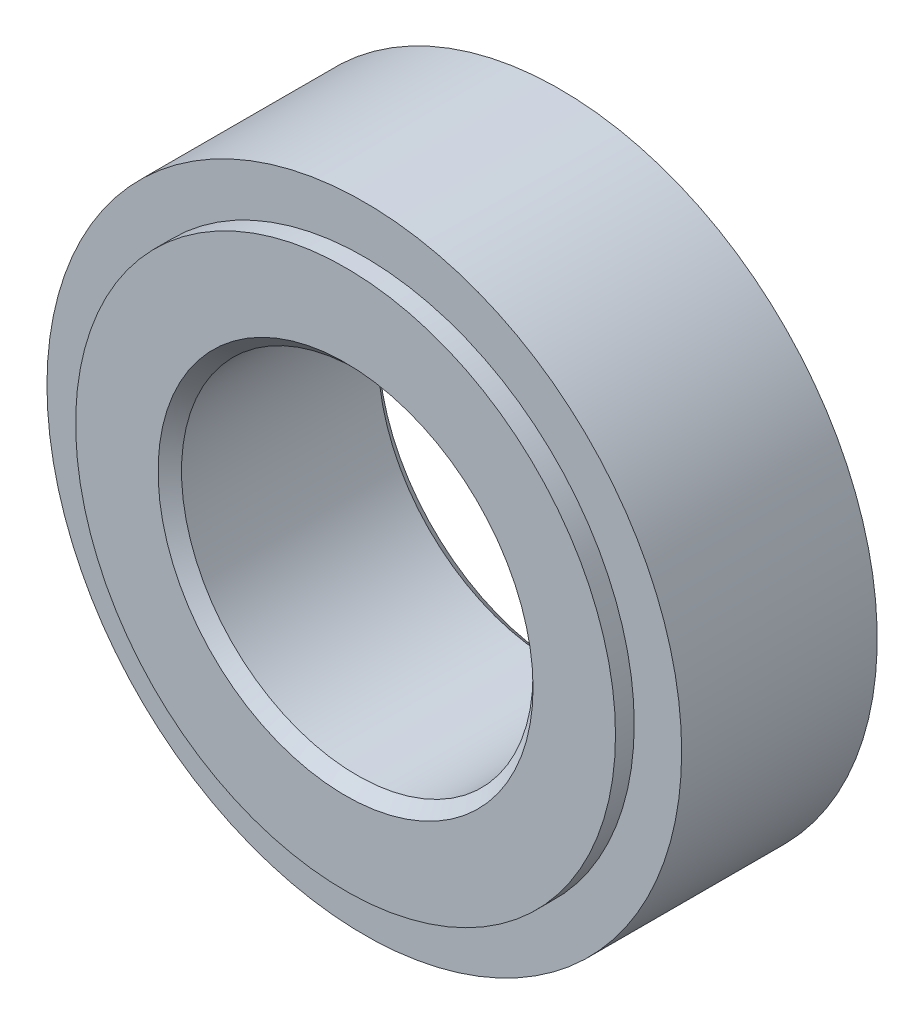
ISO-10303-21;
HEADER;
FILE_DESCRIPTION(('STEP AP214'),'2;1');
FILE_NAME('part.step','',(''),(''),'','','');
FILE_SCHEMA(('AUTOMOTIVE_DESIGN { 1 0 10303 214 1 1 1 1 }'));
ENDSEC;
DATA;
#1=APPLICATION_CONTEXT('core data for automotive mechanical design processes');
#2=APPLICATION_PROTOCOL_DEFINITION('international standard','automotive_design',2000,#1);
#3=PRODUCT_CONTEXT('',#1,'mechanical');
#4=PRODUCT('Part','Part','',(#3));
#5=PRODUCT_RELATED_PRODUCT_CATEGORY('part','',(#4));
#6=PRODUCT_DEFINITION_FORMATION('','',#4);
#7=PRODUCT_DEFINITION_CONTEXT('part definition',#1,'design');
#8=PRODUCT_DEFINITION('design','',#6,#7);
#9=PRODUCT_DEFINITION_SHAPE('','',#8);
#10=(LENGTH_UNIT() NAMED_UNIT(*) SI_UNIT(.MILLI.,.METRE.));
#11=(NAMED_UNIT(*) PLANE_ANGLE_UNIT() SI_UNIT($,.RADIAN.));
#12=(NAMED_UNIT(*) SI_UNIT($,.STERADIAN.) SOLID_ANGLE_UNIT());
#13=UNCERTAINTY_MEASURE_WITH_UNIT(LENGTH_MEASURE(1.E-05),#10,'distance_accuracy_value','');
#14=(GEOMETRIC_REPRESENTATION_CONTEXT(3) GLOBAL_UNCERTAINTY_ASSIGNED_CONTEXT((#13)) GLOBAL_UNIT_ASSIGNED_CONTEXT((#10,
#11,#12)) REPRESENTATION_CONTEXT('',''));
#15=CARTESIAN_POINT('',(0.,0.,0.));
#16=DIRECTION('',(0.,0.,1.));
#17=DIRECTION('',(1.,0.,0.));
#18=AXIS2_PLACEMENT_3D('',#15,#16,#17);
#19=CARTESIAN_POINT('',(0.,0.,9.4));
#20=DIRECTION('',(0.,0.,-1.));
#21=DIRECTION('',(-1.,0.,0.));
#22=AXIS2_PLACEMENT_3D('',#19,#20,#21);
#23=CYLINDRICAL_SURFACE('',#22,27.1);
#24=CARTESIAN_POINT('',(0.,0.,7.8));
#25=DIRECTION('',(0.,0.,1.));
#26=DIRECTION('',(1.,0.,0.));
#27=AXIS2_PLACEMENT_3D('',#24,#25,#26);
#28=CIRCLE('',#27,27.1);
#29=CARTESIAN_POINT('',(27.1,0.,7.8));
#30=VERTEX_POINT('',#29);
#31=EDGE_CURVE('E100',#30,#30,#28,.T.);
#32=ORIENTED_EDGE('',*,*,#31,.F.);
#33=EDGE_LOOP('',(#32));
#34=FACE_BOUND('',#33,.T.);
#35=CARTESIAN_POINT('',(0.,0.,-8.9));
#36=DIRECTION('',(0.,0.,-1.));
#37=DIRECTION('',(-1.,0.,0.));
#38=AXIS2_PLACEMENT_3D('',#35,#36,#37);
#39=CIRCLE('',#38,27.1);
#40=CARTESIAN_POINT('',(-27.1,0.,-8.9));
#41=VERTEX_POINT('',#40);
#42=EDGE_CURVE('E91',#41,#41,#39,.F.);
#43=ORIENTED_EDGE('',*,*,#42,.T.);
#44=EDGE_LOOP('',(#43));
#45=FACE_BOUND('',#44,.T.);
#46=ADVANCED_FACE('F33',(#34,#45),#23,.T.);
#47=CARTESIAN_POINT('',(0.,0.,7.8));
#48=DIRECTION('',(0.,0.,1.));
#49=DIRECTION('',(1.,0.,0.));
#50=AXIS2_PLACEMENT_3D('',#47,#48,#49);
#51=CYLINDRICAL_SURFACE('',#50,23.05);
#52=CARTESIAN_POINT('',(0.,0.,7.8));
#53=DIRECTION('',(0.,0.,1.));
#54=DIRECTION('',(1.,0.,0.));
#55=AXIS2_PLACEMENT_3D('',#52,#53,#54);
#56=CIRCLE('',#55,23.05);
#57=CARTESIAN_POINT('',(23.05,0.,7.8));
#58=VERTEX_POINT('',#57);
#59=EDGE_CURVE('E97',#58,#58,#56,.T.);
#60=ORIENTED_EDGE('',*,*,#59,.T.);
#61=EDGE_LOOP('',(#60));
#62=FACE_BOUND('',#61,.T.);
#63=CARTESIAN_POINT('',(0.,0.,9.4));
#64=DIRECTION('',(0.,0.,1.));
#65=DIRECTION('',(1.,0.,0.));
#66=AXIS2_PLACEMENT_3D('',#63,#64,#65);
#67=CIRCLE('',#66,23.05);
#68=CARTESIAN_POINT('',(23.05,0.,9.4));
#69=VERTEX_POINT('',#68);
#70=EDGE_CURVE('E94',#69,#69,#67,.T.);
#71=ORIENTED_EDGE('',*,*,#70,.F.);
#72=EDGE_LOOP('',(#71));
#73=FACE_BOUND('',#72,.T.);
#74=ADVANCED_FACE('F144',(#62,#73),#51,.T.);
#75=CARTESIAN_POINT('',(0.,-59.7614213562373,7.8));
#76=DIRECTION('',(0.,0.,1.));
#77=DIRECTION('',(1.,0.,0.));
#78=AXIS2_PLACEMENT_3D('',#75,#76,#77);
#79=PLANE('',#78);
#80=ORIENTED_EDGE('',*,*,#59,.F.);
#81=EDGE_LOOP('',(#80));
#82=FACE_BOUND('',#81,.T.);
#83=ORIENTED_EDGE('',*,*,#31,.T.);
#84=EDGE_LOOP('',(#83));
#85=FACE_BOUND('',#84,.T.);
#86=ADVANCED_FACE('F140',(#82,#85),#79,.T.);
#87=CARTESIAN_POINT('',(0.,0.,9.4));
#88=DIRECTION('',(0.,0.,1.));
#89=DIRECTION('',(1.,0.,0.));
#90=AXIS2_PLACEMENT_3D('',#87,#88,#89);
#91=PLANE('',#90);
#92=CARTESIAN_POINT('',(0.,0.,9.4));
#93=DIRECTION('',(0.,0.,1.));
#94=DIRECTION('',(1.,0.,0.));
#95=AXIS2_PLACEMENT_3D('',#92,#93,#94);
#96=CIRCLE('',#95,16.01);
#97=CARTESIAN_POINT('',(16.01,0.,9.4));
#98=VERTEX_POINT('',#97);
#99=EDGE_CURVE('E11',#98,#98,#96,.F.);
#100=ORIENTED_EDGE('',*,*,#99,.T.);
#101=EDGE_LOOP('',(#100));
#102=FACE_BOUND('',#101,.T.);
#103=ORIENTED_EDGE('',*,*,#70,.T.);
#104=EDGE_LOOP('',(#103));
#105=FACE_BOUND('',#104,.T.);
#106=ADVANCED_FACE('F131',(#102,#105),#91,.T.);
#107=CARTESIAN_POINT('',(0.,0.,-8.9));
#108=DIRECTION('',(0.,0.,-1.));
#109=DIRECTION('',(-1.,0.,0.));
#110=AXIS2_PLACEMENT_3D('',#107,#108,#109);
#111=CYLINDRICAL_SURFACE('',#110,23.05);
#112=CARTESIAN_POINT('',(0.,0.,-8.9));
#113=DIRECTION('',(0.,0.,-1.));
#114=DIRECTION('',(-1.,0.,0.));
#115=AXIS2_PLACEMENT_3D('',#112,#113,#114);
#116=CIRCLE('',#115,23.05);
#117=CARTESIAN_POINT('',(-23.05,0.,-8.9));
#118=VERTEX_POINT('',#117);
#119=EDGE_CURVE('E88',#118,#118,#116,.T.);
#120=ORIENTED_EDGE('',*,*,#119,.T.);
#121=EDGE_LOOP('',(#120));
#122=FACE_BOUND('',#121,.T.);
#123=CARTESIAN_POINT('',(0.,0.,-9.4));
#124=DIRECTION('',(0.,0.,-1.));
#125=DIRECTION('',(-1.,0.,0.));
#126=AXIS2_PLACEMENT_3D('',#123,#124,#125);
#127=CIRCLE('',#126,23.05);
#128=CARTESIAN_POINT('',(-23.05,0.,-9.4));
#129=VERTEX_POINT('',#128);
#130=EDGE_CURVE('E85',#129,#129,#127,.T.);
#131=ORIENTED_EDGE('',*,*,#130,.F.);
#132=EDGE_LOOP('',(#131));
#133=FACE_BOUND('',#132,.T.);
#134=ADVANCED_FACE('F129',(#122,#133),#111,.T.);
#135=CARTESIAN_POINT('',(-59.7614213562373,0.,-8.9));
#136=DIRECTION('',(0.,0.,-1.));
#137=DIRECTION('',(-1.,0.,0.));
#138=AXIS2_PLACEMENT_3D('',#135,#136,#137);
#139=PLANE('',#138);
#140=ORIENTED_EDGE('',*,*,#119,.F.);
#141=EDGE_LOOP('',(#140));
#142=FACE_BOUND('',#141,.T.);
#143=ORIENTED_EDGE('',*,*,#42,.F.);
#144=EDGE_LOOP('',(#143));
#145=FACE_BOUND('',#144,.T.);
#146=ADVANCED_FACE('F124',(#142,#145),#139,.T.);
#147=CARTESIAN_POINT('',(0.,0.,-9.4));
#148=DIRECTION('',(0.,0.,1.));
#149=DIRECTION('',(1.,0.,0.));
#150=AXIS2_PLACEMENT_3D('',#147,#148,#149);
#151=PLANE('',#150);
#152=CARTESIAN_POINT('',(0.,18.,-9.4));
#153=DIRECTION('',(0.,0.,-1.));
#154=DIRECTION('',(-1.,0.,0.));
#155=AXIS2_PLACEMENT_3D('',#152,#153,#154);
#156=CIRCLE('',#155,1.65);
#157=CARTESIAN_POINT('',(-1.65,18.,-9.4));
#158=VERTEX_POINT('',#157);
#159=EDGE_CURVE('E62',#158,#158,#156,.T.);
#160=ORIENTED_EDGE('',*,*,#159,.F.);
#161=EDGE_LOOP('',(#160));
#162=FACE_BOUND('',#161,.T.);
#163=CARTESIAN_POINT('',(18.,0.,-9.4));
#164=DIRECTION('',(0.,0.,-1.));
#165=DIRECTION('',(-1.,0.,0.));
#166=AXIS2_PLACEMENT_3D('',#163,#164,#165);
#167=CIRCLE('',#166,1.65);
#168=CARTESIAN_POINT('',(16.35,0.,-9.4));
#169=VERTEX_POINT('',#168);
#170=EDGE_CURVE('E70',#169,#169,#167,.T.);
#171=ORIENTED_EDGE('',*,*,#170,.F.);
#172=EDGE_LOOP('',(#171));
#173=FACE_BOUND('',#172,.T.);
#174=CARTESIAN_POINT('',(0.,-18.,-9.4));
#175=DIRECTION('',(0.,0.,-1.));
#176=DIRECTION('',(-1.,0.,0.));
#177=AXIS2_PLACEMENT_3D('',#174,#175,#176);
#178=CIRCLE('',#177,1.65);
#179=CARTESIAN_POINT('',(-1.65,-18.,-9.4));
#180=VERTEX_POINT('',#179);
#181=EDGE_CURVE('E76',#180,#180,#178,.T.);
#182=ORIENTED_EDGE('',*,*,#181,.F.);
#183=EDGE_LOOP('',(#182));
#184=FACE_BOUND('',#183,.T.);
#185=CARTESIAN_POINT('',(-18.,0.,-9.4));
#186=DIRECTION('',(0.,0.,-1.));
#187=DIRECTION('',(-1.,0.,0.));
#188=AXIS2_PLACEMENT_3D('',#185,#186,#187);
#189=CIRCLE('',#188,1.65);
#190=CARTESIAN_POINT('',(-19.65,0.,-9.4));
#191=VERTEX_POINT('',#190);
#192=EDGE_CURVE('E82',#191,#191,#189,.T.);
#193=ORIENTED_EDGE('',*,*,#192,.F.);
#194=EDGE_LOOP('',(#193));
#195=FACE_BOUND('',#194,.T.);
#196=CARTESIAN_POINT('',(0.,0.,-9.4));
#197=DIRECTION('',(0.,0.,1.));
#198=DIRECTION('',(1.,0.,0.));
#199=AXIS2_PLACEMENT_3D('',#196,#197,#198);
#200=CIRCLE('',#199,16.01);
#201=CARTESIAN_POINT('',(16.01,0.,-9.4));
#202=VERTEX_POINT('',#201);
#203=EDGE_CURVE('E103',#202,#202,#200,.T.);
#204=ORIENTED_EDGE('',*,*,#203,.T.);
#205=EDGE_LOOP('',(#204));
#206=FACE_BOUND('',#205,.T.);
#207=ORIENTED_EDGE('',*,*,#130,.T.);
#208=EDGE_LOOP('',(#207));
#209=FACE_BOUND('',#208,.T.);
#210=ADVANCED_FACE('F121',(#162,#173,#184,#195,#206,#209),#151,.F.);
#211=CARTESIAN_POINT('',(0.,0.,-9.4));
#212=DIRECTION('',(0.,0.,1.));
#213=DIRECTION('',(1.,0.,0.));
#214=AXIS2_PLACEMENT_3D('',#211,#212,#213);
#215=CYLINDRICAL_SURFACE('',#214,15.01);
#216=CARTESIAN_POINT('',(0.,0.,-8.4));
#217=DIRECTION('',(0.,0.,1.));
#218=DIRECTION('',(1.,0.,0.));
#219=AXIS2_PLACEMENT_3D('',#216,#217,#218);
#220=CIRCLE('',#219,15.01);
#221=CARTESIAN_POINT('',(15.01,0.,-8.4));
#222=VERTEX_POINT('',#221);
#223=EDGE_CURVE('E40',#222,#222,#220,.F.);
#224=ORIENTED_EDGE('',*,*,#223,.T.);
#225=EDGE_LOOP('',(#224));
#226=FACE_BOUND('',#225,.T.);
#227=CARTESIAN_POINT('',(0.,0.,8.4));
#228=DIRECTION('',(0.,0.,1.));
#229=DIRECTION('',(1.,0.,0.));
#230=AXIS2_PLACEMENT_3D('',#227,#228,#229);
#231=CIRCLE('',#230,15.01);
#232=CARTESIAN_POINT('',(15.01,0.,8.4));
#233=VERTEX_POINT('',#232);
#234=EDGE_CURVE('E106',#233,#233,#231,.T.);
#235=ORIENTED_EDGE('',*,*,#234,.T.);
#236=EDGE_LOOP('',(#235));
#237=FACE_BOUND('',#236,.T.);
#238=ADVANCED_FACE('F111',(#226,#237),#215,.F.);
#239=CARTESIAN_POINT('',(0.,0.,-9.4));
#240=DIRECTION('',(0.,0.,-1.));
#241=DIRECTION('',(-1.,0.,0.));
#242=AXIS2_PLACEMENT_3D('',#239,#240,#241);
#243=CONICAL_SURFACE('',#242,16.01,0.785398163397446);
#244=ORIENTED_EDGE('',*,*,#223,.F.);
#245=EDGE_LOOP('',(#244));
#246=FACE_BOUND('',#245,.T.);
#247=ORIENTED_EDGE('',*,*,#203,.F.);
#248=EDGE_LOOP('',(#247));
#249=FACE_BOUND('',#248,.T.);
#250=ADVANCED_FACE('F114',(#246,#249),#243,.F.);
#251=CARTESIAN_POINT('',(0.,0.,8.4));
#252=DIRECTION('',(0.,0.,1.));
#253=DIRECTION('',(1.,0.,0.));
#254=AXIS2_PLACEMENT_3D('',#251,#252,#253);
#255=CONICAL_SURFACE('',#254,15.01,0.785398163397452);
#256=ORIENTED_EDGE('',*,*,#99,.F.);
#257=EDGE_LOOP('',(#256));
#258=FACE_BOUND('',#257,.T.);
#259=ORIENTED_EDGE('',*,*,#234,.F.);
#260=EDGE_LOOP('',(#259));
#261=FACE_BOUND('',#260,.T.);
#262=ADVANCED_FACE('F117',(#258,#261),#255,.F.);
#263=CARTESIAN_POINT('',(-18.,0.,-9.4));
#264=DIRECTION('',(0.,0.,-1.));
#265=DIRECTION('',(-1.,0.,0.));
#266=AXIS2_PLACEMENT_3D('',#263,#264,#265);
#267=CYLINDRICAL_SURFACE('',#266,1.65);
#268=CARTESIAN_POINT('',(-18.,0.,-1.4));
#269=DIRECTION('',(0.,0.,-1.));
#270=DIRECTION('',(-1.,0.,0.));
#271=AXIS2_PLACEMENT_3D('',#268,#269,#270);
#272=CIRCLE('',#271,1.65);
#273=CARTESIAN_POINT('',(-19.65,0.,-1.4));
#274=VERTEX_POINT('',#273);
#275=EDGE_CURVE('E79',#274,#274,#272,.T.);
#276=ORIENTED_EDGE('',*,*,#275,.F.);
#277=EDGE_LOOP('',(#276));
#278=FACE_BOUND('',#277,.T.);
#279=ORIENTED_EDGE('',*,*,#192,.T.);
#280=EDGE_LOOP('',(#279));
#281=FACE_BOUND('',#280,.T.);
#282=ADVANCED_FACE('F197',(#278,#281),#267,.F.);
#283=CARTESIAN_POINT('',(-18.,0.,-1.4));
#284=DIRECTION('',(0.,0.,-1.));
#285=DIRECTION('',(-1.,0.,0.));
#286=AXIS2_PLACEMENT_3D('',#283,#284,#285);
#287=CONICAL_SURFACE('',#286,1.65,1.02974425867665);
#288=CARTESIAN_POINT('',(-18.,0.,-0.408579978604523));
#289=VERTEX_POINT('',#288);
#290=VERTEX_LOOP('',#289);
#291=FACE_BOUND('',#290,.T.);
#292=ORIENTED_EDGE('',*,*,#275,.T.);
#293=EDGE_LOOP('',(#292));
#294=FACE_BOUND('',#293,.T.);
#295=ADVANCED_FACE('F214',(#291,#294),#287,.F.);
#296=CARTESIAN_POINT('',(0.,-18.,-9.4));
#297=DIRECTION('',(0.,0.,-1.));
#298=DIRECTION('',(-1.,0.,0.));
#299=AXIS2_PLACEMENT_3D('',#296,#297,#298);
#300=CYLINDRICAL_SURFACE('',#299,1.65);
#301=CARTESIAN_POINT('',(0.,-18.,-1.4));
#302=DIRECTION('',(0.,0.,-1.));
#303=DIRECTION('',(-1.,0.,0.));
#304=AXIS2_PLACEMENT_3D('',#301,#302,#303);
#305=CIRCLE('',#304,1.65);
#306=CARTESIAN_POINT('',(-1.65,-18.,-1.4));
#307=VERTEX_POINT('',#306);
#308=EDGE_CURVE('E73',#307,#307,#305,.T.);
#309=ORIENTED_EDGE('',*,*,#308,.F.);
#310=EDGE_LOOP('',(#309));
#311=FACE_BOUND('',#310,.T.);
#312=ORIENTED_EDGE('',*,*,#181,.T.);
#313=EDGE_LOOP('',(#312));
#314=FACE_BOUND('',#313,.T.);
#315=ADVANCED_FACE('F224',(#311,#314),#300,.F.);
#316=CARTESIAN_POINT('',(0.,-18.,-1.4));
#317=DIRECTION('',(0.,0.,-1.));
#318=DIRECTION('',(-1.,0.,0.));
#319=AXIS2_PLACEMENT_3D('',#316,#317,#318);
#320=CONICAL_SURFACE('',#319,1.65,1.02974425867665);
#321=CARTESIAN_POINT('',(0.,-18.,-0.408579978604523));
#322=VERTEX_POINT('',#321);
#323=VERTEX_LOOP('',#322);
#324=FACE_BOUND('',#323,.T.);
#325=ORIENTED_EDGE('',*,*,#308,.T.);
#326=EDGE_LOOP('',(#325));
#327=FACE_BOUND('',#326,.T.);
#328=ADVANCED_FACE('F233',(#324,#327),#320,.F.);
#329=CARTESIAN_POINT('',(18.,0.,-9.4));
#330=DIRECTION('',(0.,0.,-1.));
#331=DIRECTION('',(-1.,0.,0.));
#332=AXIS2_PLACEMENT_3D('',#329,#330,#331);
#333=CYLINDRICAL_SURFACE('',#332,1.65);
#334=CARTESIAN_POINT('',(18.,0.,-1.4));
#335=DIRECTION('',(0.,0.,-1.));
#336=DIRECTION('',(-1.,0.,0.));
#337=AXIS2_PLACEMENT_3D('',#334,#335,#336);
#338=CIRCLE('',#337,1.65);
#339=CARTESIAN_POINT('',(16.35,0.,-1.4));
#340=VERTEX_POINT('',#339);
#341=EDGE_CURVE('E65',#340,#340,#338,.T.);
#342=ORIENTED_EDGE('',*,*,#341,.F.);
#343=EDGE_LOOP('',(#342));
#344=FACE_BOUND('',#343,.T.);
#345=ORIENTED_EDGE('',*,*,#170,.T.);
#346=EDGE_LOOP('',(#345));
#347=FACE_BOUND('',#346,.T.);
#348=ADVANCED_FACE('F243',(#344,#347),#333,.F.);
#349=CARTESIAN_POINT('',(18.,0.,-1.4));
#350=DIRECTION('',(0.,0.,-1.));
#351=DIRECTION('',(-1.,0.,0.));
#352=AXIS2_PLACEMENT_3D('',#349,#350,#351);
#353=CONICAL_SURFACE('',#352,1.65,1.02974425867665);
#354=CARTESIAN_POINT('',(18.,0.,-0.408579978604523));
#355=VERTEX_POINT('',#354);
#356=VERTEX_LOOP('',#355);
#357=FACE_BOUND('',#356,.T.);
#358=ORIENTED_EDGE('',*,*,#341,.T.);
#359=EDGE_LOOP('',(#358));
#360=FACE_BOUND('',#359,.T.);
#361=ADVANCED_FACE('F252',(#357,#360),#353,.F.);
#362=CARTESIAN_POINT('',(0.,18.,-9.4));
#363=DIRECTION('',(0.,0.,-1.));
#364=DIRECTION('',(-1.,0.,0.));
#365=AXIS2_PLACEMENT_3D('',#362,#363,#364);
#366=CYLINDRICAL_SURFACE('',#365,1.65);
#367=CARTESIAN_POINT('',(0.,18.,-1.4));
#368=DIRECTION('',(0.,0.,-1.));
#369=DIRECTION('',(-1.,0.,0.));
#370=AXIS2_PLACEMENT_3D('',#367,#368,#369);
#371=CIRCLE('',#370,1.65);
#372=CARTESIAN_POINT('',(-1.65,18.,-1.4));
#373=VERTEX_POINT('',#372);
#374=EDGE_CURVE('E60',#373,#373,#371,.T.);
#375=ORIENTED_EDGE('',*,*,#374,.F.);
#376=EDGE_LOOP('',(#375));
#377=FACE_BOUND('',#376,.T.);
#378=ORIENTED_EDGE('',*,*,#159,.T.);
#379=EDGE_LOOP('',(#378));
#380=FACE_BOUND('',#379,.T.);
#381=ADVANCED_FACE('F56',(#377,#380),#366,.F.);
#382=CARTESIAN_POINT('',(0.,18.,-1.4));
#383=DIRECTION('',(0.,0.,-1.));
#384=DIRECTION('',(-1.,0.,0.));
#385=AXIS2_PLACEMENT_3D('',#382,#383,#384);
#386=CONICAL_SURFACE('',#385,1.65,1.02974425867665);
#387=CARTESIAN_POINT('',(0.,18.,-0.408579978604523));
#388=VERTEX_POINT('',#387);
#389=VERTEX_LOOP('',#388);
#390=FACE_BOUND('',#389,.T.);
#391=ORIENTED_EDGE('',*,*,#374,.T.);
#392=EDGE_LOOP('',(#391));
#393=FACE_BOUND('',#392,.T.);
#394=ADVANCED_FACE('F53',(#390,#393),#386,.F.);
#395=CLOSED_SHELL('',(#46,#74,#86,#106,#134,#146,#210,#238,#250,#262,#282,#295,#315,#328,#348,
#361,#381,#394));
#396=MANIFOLD_SOLID_BREP('B2',#395);
#397=ADVANCED_BREP_SHAPE_REPRESENTATION('',(#18,#396),#14);
#398=SHAPE_DEFINITION_REPRESENTATION(#9,#397);
ENDSEC;
END-ISO-10303-21;
